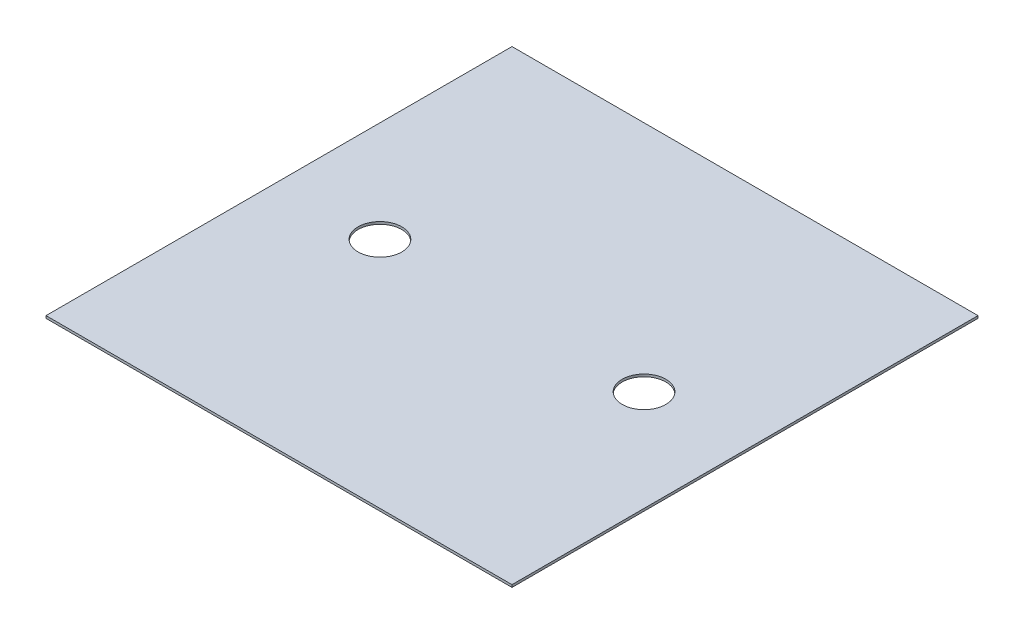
from build123d import *

# Parameters (mm, degrees)
SKETCH1_W           = 152.4
SKETCH1_H           = 152.4
BOSS_EXTRUDE1_DEPTH = 0.79375
SKETCH2_R           = 7.14375
CUT_EXTRUDE1_DEPTH  = 25.4


with BuildPart() as part:
    # Sketch1 → Boss-Extrude1 (new body)
    with BuildSketch(Plane(origin=(0, 0, 0), x_dir=(1, 0, 0), z_dir=(0, 1, 0))):
        Rectangle(SKETCH1_W, SKETCH1_H)
    extrude(amount=BOSS_EXTRUDE1_DEPTH)

    # Sketch2 → Cut-Extrude1 (cut)
    with BuildSketch(Plane(origin=(0, 0, 0), x_dir=(1, 0, 0), z_dir=(0, 1, 0))):
        with Locations(Location((-43.18, 0, 0), (0, 0, 270))):
            Circle(SKETCH2_R)
        with Locations(Location((43.18, 0, 0), (0, 0, 270))):
            Circle(SKETCH2_R)
    extrude(amount=CUT_EXTRUDE1_DEPTH, mode=Mode.SUBTRACT)


solid = part.part
